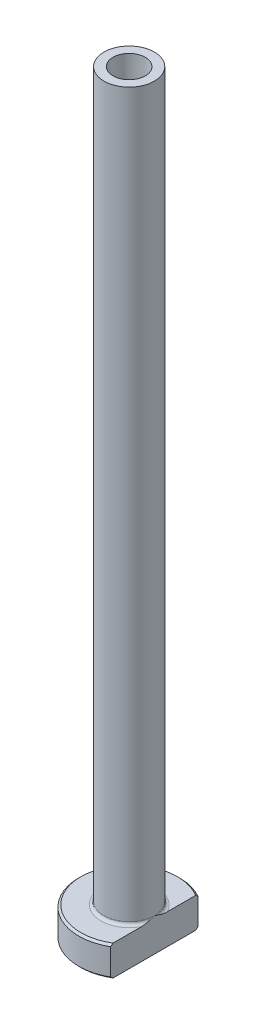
ISO-10303-21;
HEADER;
FILE_DESCRIPTION(('STEP AP214'),'2;1');
FILE_NAME('part.step','',(''),(''),'','','');
FILE_SCHEMA(('AUTOMOTIVE_DESIGN { 1 0 10303 214 1 1 1 1 }'));
ENDSEC;
DATA;
#1=APPLICATION_CONTEXT('core data for automotive mechanical design processes');
#2=APPLICATION_PROTOCOL_DEFINITION('international standard','automotive_design',2000,#1);
#3=PRODUCT_CONTEXT('',#1,'mechanical');
#4=PRODUCT('Part','Part','',(#3));
#5=PRODUCT_RELATED_PRODUCT_CATEGORY('part','',(#4));
#6=PRODUCT_DEFINITION_FORMATION('','',#4);
#7=PRODUCT_DEFINITION_CONTEXT('part definition',#1,'design');
#8=PRODUCT_DEFINITION('design','',#6,#7);
#9=PRODUCT_DEFINITION_SHAPE('','',#8);
#10=(LENGTH_UNIT() NAMED_UNIT(*) SI_UNIT(.MILLI.,.METRE.));
#11=(NAMED_UNIT(*) PLANE_ANGLE_UNIT() SI_UNIT($,.RADIAN.));
#12=(NAMED_UNIT(*) SI_UNIT($,.STERADIAN.) SOLID_ANGLE_UNIT());
#13=UNCERTAINTY_MEASURE_WITH_UNIT(LENGTH_MEASURE(1.E-05),#10,'distance_accuracy_value','');
#14=(GEOMETRIC_REPRESENTATION_CONTEXT(3) GLOBAL_UNCERTAINTY_ASSIGNED_CONTEXT((#13)) GLOBAL_UNIT_ASSIGNED_CONTEXT((#10,
#11,#12)) REPRESENTATION_CONTEXT('',''));
#15=CARTESIAN_POINT('',(0.,0.,0.));
#16=DIRECTION('',(0.,0.,1.));
#17=DIRECTION('',(1.,0.,0.));
#18=AXIS2_PLACEMENT_3D('',#15,#16,#17);
#19=CARTESIAN_POINT('',(0.,92.1876809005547,0.));
#20=DIRECTION('',(0.,1.,0.));
#21=DIRECTION('',(0.,0.,1.));
#22=AXIS2_PLACEMENT_3D('',#19,#20,#21);
#23=CYLINDRICAL_SURFACE('',#22,1.60000000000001);
#24=CARTESIAN_POINT('',(0.,75.,0.));
#25=DIRECTION('',(0.,1.,0.));
#26=DIRECTION('',(0.,0.,1.));
#27=AXIS2_PLACEMENT_3D('',#24,#25,#26);
#28=CIRCLE('',#27,1.60000000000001);
#29=CARTESIAN_POINT('',(0.,75.,1.60000000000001));
#30=VERTEX_POINT('',#29);
#31=EDGE_CURVE('E167',#30,#30,#28,.T.);
#32=ORIENTED_EDGE('',*,*,#31,.T.);
#33=EDGE_LOOP('',(#32));
#34=FACE_BOUND('',#33,.T.);
#35=CARTESIAN_POINT('',(0.,30.,0.));
#36=DIRECTION('',(0.,1.,0.));
#37=DIRECTION('',(0.,0.,1.));
#38=AXIS2_PLACEMENT_3D('',#35,#36,#37);
#39=CIRCLE('',#38,1.60000000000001);
#40=CARTESIAN_POINT('',(0.,30.,1.60000000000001));
#41=VERTEX_POINT('',#40);
#42=EDGE_CURVE('E170',#41,#41,#39,.T.);
#43=ORIENTED_EDGE('',*,*,#42,.F.);
#44=EDGE_LOOP('',(#43));
#45=FACE_BOUND('',#44,.T.);
#46=ADVANCED_FACE('F32',(#34,#45),#23,.F.);
#47=CARTESIAN_POINT('',(-1.60000000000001,75.,0.));
#48=DIRECTION('',(0.,1.,0.));
#49=DIRECTION('',(0.,0.,1.));
#50=AXIS2_PLACEMENT_3D('',#47,#48,#49);
#51=PLANE('',#50);
#52=CARTESIAN_POINT('',(0.,75.,0.));
#53=DIRECTION('',(0.,1.,0.));
#54=DIRECTION('',(0.,0.,1.));
#55=AXIS2_PLACEMENT_3D('',#52,#53,#54);
#56=CIRCLE('',#55,2.5);
#57=CARTESIAN_POINT('',(0.,75.,2.5));
#58=VERTEX_POINT('',#57);
#59=EDGE_CURVE('E174',#58,#58,#56,.T.);
#60=ORIENTED_EDGE('',*,*,#59,.T.);
#61=EDGE_LOOP('',(#60));
#62=FACE_BOUND('',#61,.T.);
#63=ORIENTED_EDGE('',*,*,#31,.F.);
#64=EDGE_LOOP('',(#63));
#65=FACE_BOUND('',#64,.T.);
#66=ADVANCED_FACE('F157',(#62,#65),#51,.T.);
#67=CARTESIAN_POINT('',(0.,92.1876809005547,0.));
#68=DIRECTION('',(0.,1.,0.));
#69=DIRECTION('',(0.,0.,1.));
#70=AXIS2_PLACEMENT_3D('',#67,#68,#69);
#71=CYLINDRICAL_SURFACE('',#70,2.49999999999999);
#72=CARTESIAN_POINT('',(0.,3.3,0.));
#73=DIRECTION('',(0.,1.,0.));
#74=DIRECTION('',(0.,0.,1.));
#75=AXIS2_PLACEMENT_3D('',#72,#73,#74);
#76=CIRCLE('',#75,2.49999999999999);
#77=CARTESIAN_POINT('',(2.49999999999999,3.3,0.));
#78=VERTEX_POINT('',#77);
#79=EDGE_CURVE('E180',#78,#78,#76,.T.);
#80=ORIENTED_EDGE('',*,*,#79,.T.);
#81=EDGE_LOOP('',(#80));
#82=FACE_BOUND('',#81,.T.);
#83=ORIENTED_EDGE('',*,*,#59,.F.);
#84=EDGE_LOOP('',(#83));
#85=FACE_BOUND('',#84,.T.);
#86=ADVANCED_FACE('F162',(#82,#85),#71,.T.);
#87=CARTESIAN_POINT('',(-2.49999999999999,3.,0.));
#88=DIRECTION('',(0.,1.,0.));
#89=DIRECTION('',(0.,0.,1.));
#90=AXIS2_PLACEMENT_3D('',#87,#88,#89);
#91=PLANE('',#90);
#92=DIRECTION('',(0.,0.,1.));
#93=VECTOR('',#92,1.);
#94=CARTESIAN_POINT('',(2.49999999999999,3.,0.));
#95=LINE('',#94,#93);
#96=CARTESIAN_POINT('',(2.49999999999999,3.,-4.09756024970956));
#97=VERTEX_POINT('',#96);
#98=CARTESIAN_POINT('',(2.49999999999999,3.,-1.26095202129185));
#99=VERTEX_POINT('',#98);
#100=EDGE_CURVE('E54',#97,#99,#95,.T.);
#101=ORIENTED_EDGE('',*,*,#100,.F.);
#102=CARTESIAN_POINT('',(0.,3.,0.));
#103=DIRECTION('',(0.,1.,0.));
#104=DIRECTION('',(0.,0.,1.));
#105=AXIS2_PLACEMENT_3D('',#102,#103,#104);
#106=CIRCLE('',#105,4.79999999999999);
#107=CARTESIAN_POINT('',(2.49999999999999,3.,4.09756024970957));
#108=VERTEX_POINT('',#107);
#109=EDGE_CURVE('E186',#97,#108,#106,.T.);
#110=ORIENTED_EDGE('',*,*,#109,.T.);
#111=CARTESIAN_POINT('',(2.49999999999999,3.,1.26095202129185));
#112=VERTEX_POINT('',#111);
#113=EDGE_CURVE('E134',#112,#108,#95,.T.);
#114=ORIENTED_EDGE('',*,*,#113,.F.);
#115=CARTESIAN_POINT('',(0.,3.,0.));
#116=DIRECTION('',(0.,1.,0.));
#117=DIRECTION('',(0.,0.,1.));
#118=AXIS2_PLACEMENT_3D('',#115,#116,#117);
#119=CIRCLE('',#118,2.79999999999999);
#120=EDGE_CURVE('E183',#112,#99,#119,.F.);
#121=ORIENTED_EDGE('',*,*,#120,.T.);
#122=EDGE_LOOP('',(#101,#110,#114,#121));
#123=FACE_BOUND('',#122,.T.);
#124=ADVANCED_FACE('F197',(#123),#91,.T.);
#125=CARTESIAN_POINT('',(0.,92.1876809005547,0.));
#126=DIRECTION('',(0.,1.,0.));
#127=DIRECTION('',(0.,0.,1.));
#128=AXIS2_PLACEMENT_3D('',#125,#126,#127);
#129=CYLINDRICAL_SURFACE('',#128,4.99999999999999);
#130=DIRECTION('',(0.,-1.,0.));
#131=VECTOR('',#130,1.);
#132=CARTESIAN_POINT('',(2.49999999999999,75.,4.33012701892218));
#133=LINE('',#132,#131);
#134=CARTESIAN_POINT('',(2.49999999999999,2.8,4.33012701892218));
#135=VERTEX_POINT('',#134);
#136=CARTESIAN_POINT('',(2.49999999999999,0.199999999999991,4.33012701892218));
#137=VERTEX_POINT('',#136);
#138=EDGE_CURVE('E82',#135,#137,#133,.T.);
#139=ORIENTED_EDGE('',*,*,#138,.F.);
#140=CARTESIAN_POINT('',(0.,2.8,0.));
#141=DIRECTION('',(0.,1.,0.));
#142=DIRECTION('',(0.,0.,1.));
#143=AXIS2_PLACEMENT_3D('',#140,#141,#142);
#144=CIRCLE('',#143,4.99999999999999);
#145=CARTESIAN_POINT('',(2.49999999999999,2.8,-4.33012701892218));
#146=VERTEX_POINT('',#145);
#147=EDGE_CURVE('E95',#135,#146,#144,.F.);
#148=ORIENTED_EDGE('',*,*,#147,.T.);
#149=DIRECTION('',(0.,-1.,0.));
#150=VECTOR('',#149,1.);
#151=CARTESIAN_POINT('',(2.49999999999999,75.,-4.33012701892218));
#152=LINE('',#151,#150);
#153=CARTESIAN_POINT('',(2.49999999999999,0.199999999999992,-4.33012701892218));
#154=VERTEX_POINT('',#153);
#155=EDGE_CURVE('E192',#146,#154,#152,.T.);
#156=ORIENTED_EDGE('',*,*,#155,.T.);
#157=CARTESIAN_POINT('',(0.,0.199999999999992,0.));
#158=DIRECTION('',(0.,-1.,0.));
#159=DIRECTION('',(0.,0.,-1.));
#160=AXIS2_PLACEMENT_3D('',#157,#158,#159);
#161=CIRCLE('',#160,4.99999999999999);
#162=EDGE_CURVE('E98',#154,#137,#161,.F.);
#163=ORIENTED_EDGE('',*,*,#162,.T.);
#164=EDGE_LOOP('',(#139,#148,#156,#163));
#165=FACE_BOUND('',#164,.T.);
#166=ADVANCED_FACE('F190',(#165),#129,.T.);
#167=CARTESIAN_POINT('',(-4.99999999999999,0.,0.));
#168=DIRECTION('',(0.,-1.,0.));
#169=DIRECTION('',(0.,0.,-1.));
#170=AXIS2_PLACEMENT_3D('',#167,#168,#169);
#171=PLANE('',#170);
#172=CARTESIAN_POINT('',(0.,0.,0.));
#173=DIRECTION('',(0.,-1.,0.));
#174=DIRECTION('',(0.,0.,-1.));
#175=AXIS2_PLACEMENT_3D('',#172,#173,#174);
#176=CIRCLE('',#175,2.34999999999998);
#177=CARTESIAN_POINT('',(0.,0.,-2.34999999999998));
#178=VERTEX_POINT('',#177);
#179=EDGE_CURVE('E40',#178,#178,#176,.F.);
#180=ORIENTED_EDGE('',*,*,#179,.T.);
#181=EDGE_LOOP('',(#180));
#182=FACE_BOUND('',#181,.T.);
#183=DIRECTION('',(0.,0.,-1.));
#184=VECTOR('',#183,1.);
#185=CARTESIAN_POINT('',(2.49999999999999,0.,4.33012701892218));
#186=LINE('',#185,#184);
#187=CARTESIAN_POINT('',(2.49999999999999,0.,4.09756024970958));
#188=VERTEX_POINT('',#187);
#189=CARTESIAN_POINT('',(2.49999999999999,0.,-4.09756024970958));
#190=VERTEX_POINT('',#189);
#191=EDGE_CURVE('E47',#188,#190,#186,.T.);
#192=ORIENTED_EDGE('',*,*,#191,.F.);
#193=CARTESIAN_POINT('',(0.,0.,0.));
#194=DIRECTION('',(0.,-1.,0.));
#195=DIRECTION('',(0.,0.,-1.));
#196=AXIS2_PLACEMENT_3D('',#193,#194,#195);
#197=CIRCLE('',#196,4.8);
#198=EDGE_CURVE('E92',#188,#190,#197,.T.);
#199=ORIENTED_EDGE('',*,*,#198,.T.);
#200=EDGE_LOOP('',(#192,#199));
#201=FACE_BOUND('',#200,.T.);
#202=ADVANCED_FACE('F91',(#182,#201),#171,.T.);
#203=CARTESIAN_POINT('',(0.,92.1876809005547,0.));
#204=DIRECTION('',(0.,1.,0.));
#205=DIRECTION('',(0.,0.,1.));
#206=AXIS2_PLACEMENT_3D('',#203,#204,#205);
#207=CYLINDRICAL_SURFACE('',#206,1.84999999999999);
#208=CARTESIAN_POINT('',(0.,0.5,0.));
#209=DIRECTION('',(0.,-1.,0.));
#210=DIRECTION('',(0.,0.,-1.));
#211=AXIS2_PLACEMENT_3D('',#208,#209,#210);
#212=CIRCLE('',#211,1.84999999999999);
#213=CARTESIAN_POINT('',(0.,0.5,-1.84999999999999));
#214=VERTEX_POINT('',#213);
#215=EDGE_CURVE('E11',#214,#214,#212,.T.);
#216=ORIENTED_EDGE('',*,*,#215,.T.);
#217=EDGE_LOOP('',(#216));
#218=FACE_BOUND('',#217,.T.);
#219=CARTESIAN_POINT('',(0.,18.,0.));
#220=DIRECTION('',(0.,1.,0.));
#221=DIRECTION('',(0.,0.,1.));
#222=AXIS2_PLACEMENT_3D('',#219,#220,#221);
#223=CIRCLE('',#222,1.84999999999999);
#224=CARTESIAN_POINT('',(0.,18.,1.84999999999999));
#225=VERTEX_POINT('',#224);
#226=EDGE_CURVE('E172',#225,#225,#223,.T.);
#227=ORIENTED_EDGE('',*,*,#226,.T.);
#228=EDGE_LOOP('',(#227));
#229=FACE_BOUND('',#228,.T.);
#230=ADVANCED_FACE('F215',(#218,#229),#207,.F.);
#231=CARTESIAN_POINT('',(0.,18.,0.));
#232=DIRECTION('',(0.,-1.,0.));
#233=DIRECTION('',(0.,0.,-1.));
#234=AXIS2_PLACEMENT_3D('',#231,#232,#233);
#235=CONICAL_SURFACE('',#234,1.84999999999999,0.0208303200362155);
#236=ORIENTED_EDGE('',*,*,#42,.T.);
#237=EDGE_LOOP('',(#236));
#238=FACE_BOUND('',#237,.T.);
#239=ORIENTED_EDGE('',*,*,#226,.F.);
#240=EDGE_LOOP('',(#239));
#241=FACE_BOUND('',#240,.T.);
#242=ADVANCED_FACE('F111',(#238,#241),#235,.F.);
#243=CARTESIAN_POINT('',(0.,3.3,0.));
#244=DIRECTION('',(0.,1.,0.));
#245=DIRECTION('',(0.,0.,1.));
#246=AXIS2_PLACEMENT_3D('',#243,#244,#245);
#247=TOROIDAL_SURFACE('',#246,2.79999999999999,0.3);
#248=ORIENTED_EDGE('',*,*,#120,.F.);
#249=CARTESIAN_POINT('',(2.49999999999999,3.3,0.));
#250=CARTESIAN_POINT('',(2.49999999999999,3.30000062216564,-4.84268097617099E-11));
#251=CARTESIAN_POINT('',(2.49999999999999,3.30000124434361,1.59620957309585E-07));
#252=CARTESIAN_POINT('',(2.49999999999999,3.30000243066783,6.45477727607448E-07));
#253=CARTESIAN_POINT('',(2.49999999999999,3.30000299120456,9.784804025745E-07));
#254=CARTESIAN_POINT('',(2.49999999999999,3.30000411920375,1.77471937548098E-06));
#255=CARTESIAN_POINT('',(2.49999999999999,3.30000467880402,2.24902093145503E-06));
#256=CARTESIAN_POINT('',(2.49999999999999,3.30000572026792,3.25953621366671E-06));
#257=CARTESIAN_POINT('',(2.49999999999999,3.3000062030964,3.79480683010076E-06));
#258=CARTESIAN_POINT('',(2.49999999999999,3.30000787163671,5.75794545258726E-06));
#259=CARTESIAN_POINT('',(2.49999999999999,3.30000896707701,7.26424016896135E-06));
#260=CARTESIAN_POINT('',(2.49999999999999,3.30001087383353,1.0336111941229E-05));
#261=CARTESIAN_POINT('',(2.49999999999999,3.3000116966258,1.18949489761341E-05));
#262=CARTESIAN_POINT('',(2.49999999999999,3.30001489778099,1.81400836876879E-05));
#263=CARTESIAN_POINT('',(2.49999999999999,3.30001712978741,2.29062159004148E-05));
#264=CARTESIAN_POINT('',(2.49999999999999,3.30002067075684,3.21793844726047E-05));
#265=CARTESIAN_POINT('',(2.49999999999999,3.30002205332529,3.66588967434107E-05));
#266=CARTESIAN_POINT('',(2.49999999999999,3.30002810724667,5.61718370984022E-05));
#267=CARTESIAN_POINT('',(2.49999999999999,3.30003284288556,7.11735820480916E-05));
#268=CARTESIAN_POINT('',(2.49999999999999,3.30004025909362,9.89920273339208E-05));
#269=CARTESIAN_POINT('',(2.49999999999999,3.30004315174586,0.000111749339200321));
#270=CARTESIAN_POINT('',(2.49999999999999,3.30006652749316,0.000206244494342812));
#271=CARTESIAN_POINT('',(2.49999999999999,3.30009698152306,0.000285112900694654));
#272=CARTESIAN_POINT('',(2.49999999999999,3.3002121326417,0.000594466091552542));
#273=CARTESIAN_POINT('',(2.49999999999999,3.30028938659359,0.000826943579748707));
#274=CARTESIAN_POINT('',(2.49999999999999,3.30059681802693,0.0017388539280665));
#275=CARTESIAN_POINT('',(2.49999999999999,3.30083479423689,0.00241625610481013));
#276=CARTESIAN_POINT('',(2.49999999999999,3.30181198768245,0.00521069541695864));
#277=CARTESIAN_POINT('',(2.49999999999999,3.30254240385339,0.00732996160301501));
#278=CARTESIAN_POINT('',(2.49999999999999,3.31226043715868,0.0355096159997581));
#279=CARTESIAN_POINT('',(2.49999999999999,3.32130808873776,0.0615551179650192));
#280=CARTESIAN_POINT('',(2.49999999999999,3.33896212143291,0.112677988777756));
#281=CARTESIAN_POINT('',(2.49999999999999,3.34757212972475,0.137754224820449));
#282=CARTESIAN_POINT('',(2.49999999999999,3.36573068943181,0.1909818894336));
#283=CARTESIAN_POINT('',(2.49999999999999,3.37526654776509,0.219137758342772));
#284=CARTESIAN_POINT('',(2.49999999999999,3.39422867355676,0.275816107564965));
#285=CARTESIAN_POINT('',(2.49999999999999,3.40365272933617,0.304339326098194));
#286=CARTESIAN_POINT('',(2.49999999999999,3.42641697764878,0.374416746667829));
#287=CARTESIAN_POINT('',(2.49999999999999,3.43959811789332,0.416023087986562));
#288=CARTESIAN_POINT('',(2.49999999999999,3.46479157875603,0.498481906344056));
#289=CARTESIAN_POINT('',(2.49999999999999,3.47682455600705,0.539328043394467));
#290=CARTESIAN_POINT('',(2.49999999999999,3.50224427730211,0.62998152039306));
#291=CARTESIAN_POINT('',(2.49999999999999,3.51538048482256,0.679860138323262));
#292=CARTESIAN_POINT('',(2.49999999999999,3.53964074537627,0.780511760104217));
#293=CARTESIAN_POINT('',(2.49999999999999,3.55074877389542,0.831288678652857));
#294=CARTESIAN_POINT('',(2.49999999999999,3.57087054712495,0.937063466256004));
#295=CARTESIAN_POINT('',(2.49999999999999,3.5796762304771,0.992102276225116));
#296=CARTESIAN_POINT('',(2.49999999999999,3.59301148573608,1.10256024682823));
#297=CARTESIAN_POINT('',(2.49999999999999,3.59755297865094,1.1579779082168));
#298=CARTESIAN_POINT('',(2.49999999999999,3.60093314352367,1.26786705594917));
#299=CARTESIAN_POINT('',(2.49999999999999,3.59989366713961,1.32233291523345));
#300=CARTESIAN_POINT('',(2.49999999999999,3.59277279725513,1.40310062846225));
#301=CARTESIAN_POINT('',(2.49999999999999,3.58952137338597,1.42965222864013));
#302=CARTESIAN_POINT('',(2.49999999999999,3.58085857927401,1.48239078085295));
#303=CARTESIAN_POINT('',(2.49999999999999,3.57544928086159,1.50857805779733));
#304=CARTESIAN_POINT('',(2.49999999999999,3.56298810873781,1.55658799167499));
#305=CARTESIAN_POINT('',(2.49999999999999,3.55628200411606,1.57849902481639));
#306=CARTESIAN_POINT('',(2.49999999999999,3.54055393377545,1.62160292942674));
#307=CARTESIAN_POINT('',(2.49999999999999,3.53152220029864,1.64279233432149));
#308=CARTESIAN_POINT('',(2.49999999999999,3.51057199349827,1.68404469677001));
#309=CARTESIAN_POINT('',(2.49999999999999,3.49862012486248,1.70409105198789));
#310=CARTESIAN_POINT('',(2.49999999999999,3.47134074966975,1.74172093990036));
#311=CARTESIAN_POINT('',(2.49999999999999,3.45603127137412,1.75931683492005));
#312=CARTESIAN_POINT('',(2.49999999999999,3.42979930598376,1.78297070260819));
#313=CARTESIAN_POINT('',(2.49999999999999,3.42024268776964,1.79054141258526));
#314=CARTESIAN_POINT('',(2.49999999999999,3.40009035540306,1.80416997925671));
#315=CARTESIAN_POINT('',(2.49999999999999,3.38949499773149,1.81022835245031));
#316=CARTESIAN_POINT('',(2.49999999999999,3.36727740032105,1.82047087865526));
#317=CARTESIAN_POINT('',(2.49999999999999,3.35564531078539,1.82463409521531));
#318=CARTESIAN_POINT('',(2.49999999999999,3.33178837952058,1.83058442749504));
#319=CARTESIAN_POINT('',(2.49999999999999,3.31956435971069,1.83237474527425));
#320=CARTESIAN_POINT('',(2.49999999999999,3.29665736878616,1.83331852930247));
#321=CARTESIAN_POINT('',(2.49999999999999,3.28598670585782,1.83279233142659));
#322=CARTESIAN_POINT('',(2.49999999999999,3.26490749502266,1.82986307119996));
#323=CARTESIAN_POINT('',(2.49999999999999,3.25449899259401,1.82745968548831));
#324=CARTESIAN_POINT('',(2.49999999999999,3.2346709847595,1.8211125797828));
#325=CARTESIAN_POINT('',(2.49999999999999,3.22522816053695,1.81724026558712));
#326=CARTESIAN_POINT('',(2.49999999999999,3.20699535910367,1.80819497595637));
#327=CARTESIAN_POINT('',(2.49999999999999,3.19820556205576,1.80302164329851));
#328=CARTESIAN_POINT('',(2.49999999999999,3.17663162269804,1.7884211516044));
#329=CARTESIAN_POINT('',(2.49999999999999,3.16436228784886,1.77823293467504));
#330=CARTESIAN_POINT('',(2.49999999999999,3.14157828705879,1.75604629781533));
#331=CARTESIAN_POINT('',(2.49999999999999,3.13106906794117,1.74404246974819));
#332=CARTESIAN_POINT('',(2.49999999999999,3.10600520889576,1.71142114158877));
#333=CARTESIAN_POINT('',(2.49999999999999,3.09267476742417,1.68986887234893));
#334=CARTESIAN_POINT('',(2.49999999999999,3.06940323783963,1.64508572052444));
#335=CARTESIAN_POINT('',(2.49999999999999,3.05946314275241,1.62185434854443));
#336=CARTESIAN_POINT('',(2.49999999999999,3.03545750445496,1.55546754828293));
#337=CARTESIAN_POINT('',(2.49999999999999,3.02444022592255,1.5112218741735));
#338=CARTESIAN_POINT('',(2.49999999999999,3.00863926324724,1.42119777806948));
#339=CARTESIAN_POINT('',(2.49999999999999,3.00393876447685,1.37540689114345));
#340=CARTESIAN_POINT('',(2.49999999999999,2.99924212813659,1.280721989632));
#341=CARTESIAN_POINT('',(2.49999999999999,2.99956098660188,1.23181420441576));
#342=CARTESIAN_POINT('',(2.49999999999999,3.00436098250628,1.13410944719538));
#343=CARTESIAN_POINT('',(2.49999999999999,3.00885327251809,1.08531312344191));
#344=CARTESIAN_POINT('',(2.49999999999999,3.02074191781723,0.99077345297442));
#345=CARTESIAN_POINT('',(2.49999999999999,3.02796792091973,0.945007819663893));
#346=CARTESIAN_POINT('',(2.49999999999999,3.04465555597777,0.85419946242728));
#347=CARTESIAN_POINT('',(2.49999999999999,3.05410250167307,0.809153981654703));
#348=CARTESIAN_POINT('',(2.49999999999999,3.07710029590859,0.709411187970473));
#349=CARTESIAN_POINT('',(2.49999999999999,3.09109633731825,0.654817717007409));
#350=CARTESIAN_POINT('',(2.49999999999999,3.12140740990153,0.544863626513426));
#351=CARTESIAN_POINT('',(2.49999999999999,3.13777040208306,0.489516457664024));
#352=CARTESIAN_POINT('',(2.49999999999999,3.16649540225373,0.396740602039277));
#353=CARTESIAN_POINT('',(2.5,3.17848130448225,0.35919385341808));
#354=CARTESIAN_POINT('',(2.49999999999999,3.20280507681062,0.28465180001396));
#355=CARTESIAN_POINT('',(2.49999999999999,3.21513791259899,0.247654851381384));
#356=CARTESIAN_POINT('',(2.5,3.23873713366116,0.177767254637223));
#357=CARTESIAN_POINT('',(2.5,3.24997409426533,0.144866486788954));
#358=CARTESIAN_POINT('',(2.49999999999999,3.27307149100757,0.0777985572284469));
#359=CARTESIAN_POINT('',(2.49999999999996,3.28493883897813,0.0436336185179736));
#360=CARTESIAN_POINT('',(2.5,3.29745794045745,0.00732879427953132));
#361=CARTESIAN_POINT('',(2.5,3.29818879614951,0.00520838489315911));
#362=CARTESIAN_POINT('',(2.49999999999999,3.29916610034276,0.00241367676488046));
#363=CARTESIAN_POINT('',(2.49999999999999,3.29940376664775,0.00173715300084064));
#364=CARTESIAN_POINT('',(2.5,3.29971082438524,0.000826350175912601));
#365=CARTESIAN_POINT('',(2.5,3.29978800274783,0.000594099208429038));
#366=CARTESIAN_POINT('',(2.49999999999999,3.29990305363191,0.000285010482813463));
#367=CARTESIAN_POINT('',(2.49999999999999,3.29993349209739,0.00020618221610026));
#368=CARTESIAN_POINT('',(2.49999999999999,3.299956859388,0.000111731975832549));
#369=CARTESIAN_POINT('',(2.5,3.29995975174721,9.89774262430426E-05));
#370=CARTESIAN_POINT('',(2.5,3.29996716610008,7.11651832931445E-05));
#371=CARTESIAN_POINT('',(2.49999999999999,3.29997189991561,5.61668057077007E-05));
#372=CARTESIAN_POINT('',(2.49999999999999,3.2999779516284,3.6657630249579E-05));
#373=CARTESIAN_POINT('',(2.49999999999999,3.29997933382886,3.21785218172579E-05));
#374=CARTESIAN_POINT('',(2.49999999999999,3.29998287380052,2.29061351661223E-05));
#375=CARTESIAN_POINT('',(2.49999999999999,3.29998510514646,1.81403642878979E-05));
#376=CARTESIAN_POINT('',(2.49999999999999,3.29998830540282,1.18955810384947E-05));
#377=CARTESIAN_POINT('',(2.49999999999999,3.29998912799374,1.03367749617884E-05));
#378=CARTESIAN_POINT('',(2.49999999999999,3.29999103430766,7.26492671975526E-06));
#379=CARTESIAN_POINT('',(2.49999999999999,3.29999212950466,5.75862185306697E-06));
#380=CARTESIAN_POINT('',(2.49999999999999,3.29999379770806,3.79542398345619E-06));
#381=CARTESIAN_POINT('',(2.49999999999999,3.2999942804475,3.26012692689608E-06));
#382=CARTESIAN_POINT('',(2.49999999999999,3.29999532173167,2.24954273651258E-06));
#383=CARTESIAN_POINT('',(2.49999999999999,3.29999588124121,1.77519843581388E-06));
#384=CARTESIAN_POINT('',(2.49999999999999,3.29999700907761,9.78856738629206E-07));
#385=CARTESIAN_POINT('',(2.49999999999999,3.29999756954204,6.45796776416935E-07));
#386=CARTESIAN_POINT('',(2.49999999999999,3.29999875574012,1.59799494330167E-07));
#387=CARTESIAN_POINT('',(2.49999999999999,3.2999993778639,4.84250111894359E-11));
#388=CARTESIAN_POINT('',(2.49999999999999,3.3,0.));
#389=B_SPLINE_CURVE_WITH_KNOTS('',3,(#249,#250,#251,#252,#253,#254,#255,#256,#257,#258,#259,
#260,#261,#262,#263,#264,#265,#266,#267,#268,#269,#270,#271,#272,#273,#274,#275,#276,#277,#278,
#279,#280,#281,#282,#283,#284,#285,#286,#287,#288,#289,#290,#291,#292,#293,#294,#295,#296,#297,
#298,#299,#300,#301,#302,#303,#304,#305,#306,#307,#308,#309,#310,#311,#312,#313,#314,#315,#316,
#317,#318,#319,#320,#321,#322,#323,#324,#325,#326,#327,#328,#329,#330,#331,#332,#333,#334,#335,
#336,#337,#338,#339,#340,#341,#342,#343,#344,#345,#346,#347,#348,#349,#350,#351,#352,#353,#354,
#355,#356,#357,#358,#359,#360,#361,#362,#363,#364,#365,#366,#367,#368,#369,#370,#371,#372,#373,
#374,#375,#376,#377,#378,#379,#380,#381,#382,#383,#384,#385,#386,#387,#388),.UNSPECIFIED.,.T.,
.F.,(4,2,2,2,2,2,2,2,2,2,2,2,2,2,2,2,2,2,2,2,2,2,2,2,2,2,2,2,2,2,2,2,2,2,2,2,2,2,2,2,2,2,2,2,2,
2,2,2,2,2,2,2,2,2,2,2,2,2,2,2,2,2,2,2,2,2,2,2,2,4),(0.,1.86789340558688E-06,
3.81549813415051E-06,6.00610739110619E-06,8.16653309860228E-06,1.37285630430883E-05,
1.9012222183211E-05,3.47597341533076E-05,4.88082683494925E-05,9.59978494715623E-05,
0.000135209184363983,0.000388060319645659,0.00112364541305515,0.00327678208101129,
0.010002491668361,0.0927120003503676,0.172253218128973,0.261432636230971,0.351551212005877,
0.482477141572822,0.610212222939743,0.76491521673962,0.920792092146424,1.0878789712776,
1.2544973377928,1.41749285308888,1.49767530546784,1.57778095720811,1.64642481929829,
1.71536183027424,1.78512750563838,1.85452737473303,1.89099315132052,1.92744645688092,
1.96429324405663,2.00109025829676,2.03297105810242,2.06485735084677,2.09535926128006,
2.1258695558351,2.17344034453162,2.22115572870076,2.2967513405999,2.37236907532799,
2.50839721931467,2.64619971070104,2.79268284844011,2.93955855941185,3.07848421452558,
3.21651583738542,3.38554045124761,3.55865938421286,3.67689643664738,3.79388863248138,
3.89819085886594,4.00668323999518,4.01341261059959,4.0155629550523,4.01629782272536,
4.01655054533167,4.0165897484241,4.01663692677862,4.01665097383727,4.01666671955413,
4.01667200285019,4.01667756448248,4.01667972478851,4.01668191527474,4.01668386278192,
4.01668573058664),.UNSPECIFIED.);
#390=EDGE_CURVE('E126',#112,#78,#389,.T.);
#391=ORIENTED_EDGE('',*,*,#390,.T.);
#392=ORIENTED_EDGE('',*,*,#79,.F.);
#393=CARTESIAN_POINT('',(2.49999999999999,3.3,0.));
#394=CARTESIAN_POINT('',(2.49999999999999,3.29999937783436,4.84272220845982E-11));
#395=CARTESIAN_POINT('',(2.49999999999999,3.29999875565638,-1.59620956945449E-07));
#396=CARTESIAN_POINT('',(2.49999999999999,3.29999756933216,-6.45477727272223E-07));
#397=CARTESIAN_POINT('',(2.49999999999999,3.29999700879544,-9.78480402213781E-07));
#398=CARTESIAN_POINT('',(2.49999999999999,3.29999588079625,-1.77471937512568E-06));
#399=CARTESIAN_POINT('',(2.49999999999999,3.29999532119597,-2.24902093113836E-06));
#400=CARTESIAN_POINT('',(2.49999999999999,3.29999427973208,-3.25953621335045E-06));
#401=CARTESIAN_POINT('',(2.49999999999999,3.2999937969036,-3.79480682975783E-06));
#402=CARTESIAN_POINT('',(2.49999999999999,3.29999212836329,-5.7579454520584E-06));
#403=CARTESIAN_POINT('',(2.49999999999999,3.29999103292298,-7.2642401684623E-06));
#404=CARTESIAN_POINT('',(2.49999999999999,3.29998912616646,-1.03361119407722E-05));
#405=CARTESIAN_POINT('',(2.49999999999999,3.2999883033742,-1.18949489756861E-05));
#406=CARTESIAN_POINT('',(2.49999999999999,3.299985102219,-1.81400836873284E-05));
#407=CARTESIAN_POINT('',(2.49999999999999,3.29998287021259,-2.29062158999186E-05));
#408=CARTESIAN_POINT('',(2.49999999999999,3.29997932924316,-3.21793844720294E-05));
#409=CARTESIAN_POINT('',(2.49999999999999,3.29997794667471,-3.66588967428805E-05));
#410=CARTESIAN_POINT('',(2.49999999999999,3.29997189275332,-5.61718370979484E-05));
#411=CARTESIAN_POINT('',(2.49999999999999,3.29996715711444,-7.11735820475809E-05));
#412=CARTESIAN_POINT('',(2.49999999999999,3.29995974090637,-9.89920273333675E-05));
#413=CARTESIAN_POINT('',(2.49999999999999,3.29995684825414,-0.000111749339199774));
#414=CARTESIAN_POINT('',(2.49999999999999,3.29993347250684,-0.000206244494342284));
#415=CARTESIAN_POINT('',(2.49999999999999,3.29990301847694,-0.000285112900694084));
#416=CARTESIAN_POINT('',(2.49999999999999,3.2997878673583,-0.000594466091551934));
#417=CARTESIAN_POINT('',(2.49999999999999,3.29971061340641,-0.000826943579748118));
#418=CARTESIAN_POINT('',(2.49999999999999,3.29940318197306,-0.00173885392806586));
#419=CARTESIAN_POINT('',(2.49999999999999,3.29916520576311,-0.00241625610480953));
#420=CARTESIAN_POINT('',(2.49999999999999,3.29818801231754,-0.00521069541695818));
#421=CARTESIAN_POINT('',(2.49999999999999,3.2974575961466,-0.0073299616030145));
#422=CARTESIAN_POINT('',(2.49999999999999,3.28773956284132,-0.0355096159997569));
#423=CARTESIAN_POINT('',(2.49999999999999,3.27869191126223,-0.0615551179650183));
#424=CARTESIAN_POINT('',(2.49999999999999,3.26103787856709,-0.112677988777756));
#425=CARTESIAN_POINT('',(2.49999999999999,3.25242787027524,-0.137754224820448));
#426=CARTESIAN_POINT('',(2.49999999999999,3.23426931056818,-0.190981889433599));
#427=CARTESIAN_POINT('',(2.49999999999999,3.2247334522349,-0.21913775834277));
#428=CARTESIAN_POINT('',(2.49999999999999,3.20577132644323,-0.275816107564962));
#429=CARTESIAN_POINT('',(2.49999999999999,3.19634727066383,-0.304339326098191));
#430=CARTESIAN_POINT('',(2.49999999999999,3.17358302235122,-0.374416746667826));
#431=CARTESIAN_POINT('',(2.49999999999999,3.16040188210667,-0.416023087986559));
#432=CARTESIAN_POINT('',(2.49999999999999,3.13520842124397,-0.498481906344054));
#433=CARTESIAN_POINT('',(2.49999999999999,3.12317544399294,-0.539328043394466));
#434=CARTESIAN_POINT('',(2.49999999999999,3.09775572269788,-0.629981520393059));
#435=CARTESIAN_POINT('',(2.49999999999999,3.08461951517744,-0.679860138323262));
#436=CARTESIAN_POINT('',(2.49999999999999,3.06035925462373,-0.780511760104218));
#437=CARTESIAN_POINT('',(2.49999999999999,3.04925122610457,-0.831288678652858));
#438=CARTESIAN_POINT('',(2.49999999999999,3.02912945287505,-0.937063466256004));
#439=CARTESIAN_POINT('',(2.49999999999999,3.0203237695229,-0.992102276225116));
#440=CARTESIAN_POINT('',(2.49999999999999,3.00698851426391,-1.10256024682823));
#441=CARTESIAN_POINT('',(2.49999999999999,3.00244702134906,-1.1579779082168));
#442=CARTESIAN_POINT('',(2.49999999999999,2.99906685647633,-1.26786705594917));
#443=CARTESIAN_POINT('',(2.49999999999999,3.00010633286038,-1.32233291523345));
#444=CARTESIAN_POINT('',(2.49999999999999,3.00722720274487,-1.40310062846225));
#445=CARTESIAN_POINT('',(2.49999999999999,3.01047862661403,-1.42965222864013));
#446=CARTESIAN_POINT('',(2.49999999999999,3.01914142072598,-1.48239078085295));
#447=CARTESIAN_POINT('',(2.49999999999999,3.0245507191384,-1.50857805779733));
#448=CARTESIAN_POINT('',(2.49999999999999,3.03701189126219,-1.55658799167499));
#449=CARTESIAN_POINT('',(2.49999999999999,3.04371799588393,-1.57849902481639));
#450=CARTESIAN_POINT('',(2.49999999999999,3.05944606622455,-1.62160292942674));
#451=CARTESIAN_POINT('',(2.49999999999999,3.06847779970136,-1.64279233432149));
#452=CARTESIAN_POINT('',(2.49999999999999,3.08942800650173,-1.68404469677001));
#453=CARTESIAN_POINT('',(2.49999999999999,3.10137987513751,-1.70409105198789));
#454=CARTESIAN_POINT('',(2.49999999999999,3.12865925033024,-1.74172093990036));
#455=CARTESIAN_POINT('',(2.49999999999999,3.14396872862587,-1.75931683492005));
#456=CARTESIAN_POINT('',(2.49999999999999,3.17020069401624,-1.78297070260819));
#457=CARTESIAN_POINT('',(2.49999999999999,3.17975731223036,-1.79054141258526));
#458=CARTESIAN_POINT('',(2.49999999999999,3.19990964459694,-1.80416997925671));
#459=CARTESIAN_POINT('',(2.49999999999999,3.21050500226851,-1.81022835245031));
#460=CARTESIAN_POINT('',(2.49999999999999,3.23272259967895,-1.82047087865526));
#461=CARTESIAN_POINT('',(2.49999999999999,3.2443546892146,-1.82463409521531));
#462=CARTESIAN_POINT('',(2.49999999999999,3.26821162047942,-1.83058442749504));
#463=CARTESIAN_POINT('',(2.49999999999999,3.2804356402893,-1.83237474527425));
#464=CARTESIAN_POINT('',(2.49999999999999,3.30334263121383,-1.83331852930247));
#465=CARTESIAN_POINT('',(2.49999999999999,3.31401329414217,-1.83279233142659));
#466=CARTESIAN_POINT('',(2.49999999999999,3.33509250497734,-1.82986307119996));
#467=CARTESIAN_POINT('',(2.49999999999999,3.34550100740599,-1.82745968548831));
#468=CARTESIAN_POINT('',(2.49999999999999,3.3653290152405,-1.8211125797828));
#469=CARTESIAN_POINT('',(2.49999999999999,3.37477183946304,-1.81724026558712));
#470=CARTESIAN_POINT('',(2.49999999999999,3.39300464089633,-1.80819497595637));
#471=CARTESIAN_POINT('',(2.49999999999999,3.40179443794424,-1.80302164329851));
#472=CARTESIAN_POINT('',(2.49999999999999,3.42336837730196,-1.7884211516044));
#473=CARTESIAN_POINT('',(2.49999999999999,3.43563771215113,-1.77823293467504));
#474=CARTESIAN_POINT('',(2.49999999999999,3.4584217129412,-1.75604629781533));
#475=CARTESIAN_POINT('',(2.49999999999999,3.46893093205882,-1.74404246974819));
#476=CARTESIAN_POINT('',(2.49999999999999,3.49399479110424,-1.71142114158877));
#477=CARTESIAN_POINT('',(2.49999999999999,3.50732523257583,-1.68986887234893));
#478=CARTESIAN_POINT('',(2.49999999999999,3.53059676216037,-1.64508572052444));
#479=CARTESIAN_POINT('',(2.49999999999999,3.54053685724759,-1.62185434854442));
#480=CARTESIAN_POINT('',(2.49999999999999,3.56454249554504,-1.55546754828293));
#481=CARTESIAN_POINT('',(2.49999999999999,3.57555977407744,-1.5112218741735));
#482=CARTESIAN_POINT('',(2.49999999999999,3.59136073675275,-1.42119777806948));
#483=CARTESIAN_POINT('',(2.49999999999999,3.59606123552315,-1.37540689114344));
#484=CARTESIAN_POINT('',(2.49999999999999,3.6007578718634,-1.280721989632));
#485=CARTESIAN_POINT('',(2.49999999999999,3.60043901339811,-1.23181420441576));
#486=CARTESIAN_POINT('',(2.49999999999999,3.59563901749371,-1.13410944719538));
#487=CARTESIAN_POINT('',(2.49999999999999,3.5911467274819,-1.08531312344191));
#488=CARTESIAN_POINT('',(2.49999999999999,3.57925808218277,-0.99077345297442));
#489=CARTESIAN_POINT('',(2.49999999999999,3.57203207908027,-0.945007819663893));
#490=CARTESIAN_POINT('',(2.49999999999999,3.55534444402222,-0.85419946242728));
#491=CARTESIAN_POINT('',(2.49999999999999,3.54589749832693,-0.809153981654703));
#492=CARTESIAN_POINT('',(2.49999999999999,3.52289970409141,-0.709411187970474));
#493=CARTESIAN_POINT('',(2.49999999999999,3.50890366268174,-0.65481771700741));
#494=CARTESIAN_POINT('',(2.49999999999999,3.47859259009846,-0.544863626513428));
#495=CARTESIAN_POINT('',(2.49999999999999,3.46222959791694,-0.489516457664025));
#496=CARTESIAN_POINT('',(2.49999999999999,3.43350459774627,-0.396740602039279));
#497=CARTESIAN_POINT('',(2.49999999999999,3.42151869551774,-0.359193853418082));
#498=CARTESIAN_POINT('',(2.49999999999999,3.39719492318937,-0.284651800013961));
#499=CARTESIAN_POINT('',(2.49999999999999,3.384862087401,-0.247654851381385));
#500=CARTESIAN_POINT('',(2.49999999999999,3.36126286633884,-0.177767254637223));
#501=CARTESIAN_POINT('',(2.49999999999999,3.35002590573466,-0.144866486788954));
#502=CARTESIAN_POINT('',(2.49999999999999,3.32692850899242,-0.0777985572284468));
#503=CARTESIAN_POINT('',(2.49999999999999,3.31506116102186,-0.0436336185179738));
#504=CARTESIAN_POINT('',(2.49999999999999,3.30254205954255,-0.00732879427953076));
#505=CARTESIAN_POINT('',(2.49999999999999,3.30181120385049,-0.00520838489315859));
#506=CARTESIAN_POINT('',(2.49999999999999,3.30083389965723,-0.00241367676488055));
#507=CARTESIAN_POINT('',(2.49999999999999,3.30059623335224,-0.00173715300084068));
#508=CARTESIAN_POINT('',(2.49999999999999,3.30028917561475,-0.000826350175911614));
#509=CARTESIAN_POINT('',(2.49999999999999,3.30021199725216,-0.000594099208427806));
#510=CARTESIAN_POINT('',(2.49999999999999,3.30009694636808,-0.000285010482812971));
#511=CARTESIAN_POINT('',(2.49999999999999,3.3000665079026,-0.000206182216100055));
#512=CARTESIAN_POINT('',(2.49999999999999,3.30004314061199,-0.000111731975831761));
#513=CARTESIAN_POINT('',(2.49999999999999,3.30004024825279,-9.89774262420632E-05));
#514=CARTESIAN_POINT('',(2.49999999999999,3.30003283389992,-7.11651832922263E-05));
#515=CARTESIAN_POINT('',(2.49999999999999,3.30002810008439,-5.61668057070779E-05));
#516=CARTESIAN_POINT('',(2.49999999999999,3.3000220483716,-3.6657630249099E-05));
#517=CARTESIAN_POINT('',(2.49999999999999,3.30002066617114,-3.21785218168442E-05));
#518=CARTESIAN_POINT('',(2.49999999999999,3.30001712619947,-2.29061351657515E-05));
#519=CARTESIAN_POINT('',(2.49999999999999,3.30001489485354,-1.81403642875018E-05));
#520=CARTESIAN_POINT('',(2.49999999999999,3.30001169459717,-1.18955810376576E-05));
#521=CARTESIAN_POINT('',(2.49999999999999,3.30001087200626,-1.03367749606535E-05));
#522=CARTESIAN_POINT('',(2.49999999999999,3.30000896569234,-7.26492671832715E-06));
#523=CARTESIAN_POINT('',(2.49999999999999,3.30000787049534,-5.75862185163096E-06));
#524=CARTESIAN_POINT('',(2.49999999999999,3.30000620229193,-3.7954239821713E-06));
#525=CARTESIAN_POINT('',(2.49999999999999,3.30000571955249,-3.26012692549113E-06));
#526=CARTESIAN_POINT('',(2.49999999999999,3.30000467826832,-2.24954273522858E-06));
#527=CARTESIAN_POINT('',(2.49999999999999,3.30000411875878,-1.7751984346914E-06));
#528=CARTESIAN_POINT('',(2.49999999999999,3.30000299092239,-9.78856737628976E-07));
#529=CARTESIAN_POINT('',(2.49999999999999,3.30000243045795,-6.45796775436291E-07));
#530=CARTESIAN_POINT('',(2.49999999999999,3.30000124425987,-1.59799493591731E-07));
#531=CARTESIAN_POINT('',(2.49999999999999,3.3000006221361,-4.84244219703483E-11));
#532=CARTESIAN_POINT('',(2.49999999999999,3.3,0.));
#533=B_SPLINE_CURVE_WITH_KNOTS('',3,(#393,#394,#395,#396,#397,#398,#399,#400,#401,#402,#403,
#404,#405,#406,#407,#408,#409,#410,#411,#412,#413,#414,#415,#416,#417,#418,#419,#420,#421,#422,
#423,#424,#425,#426,#427,#428,#429,#430,#431,#432,#433,#434,#435,#436,#437,#438,#439,#440,#441,
#442,#443,#444,#445,#446,#447,#448,#449,#450,#451,#452,#453,#454,#455,#456,#457,#458,#459,#460,
#461,#462,#463,#464,#465,#466,#467,#468,#469,#470,#471,#472,#473,#474,#475,#476,#477,#478,#479,
#480,#481,#482,#483,#484,#485,#486,#487,#488,#489,#490,#491,#492,#493,#494,#495,#496,#497,#498,
#499,#500,#501,#502,#503,#504,#505,#506,#507,#508,#509,#510,#511,#512,#513,#514,#515,#516,#517,
#518,#519,#520,#521,#522,#523,#524,#525,#526,#527,#528,#529,#530,#531,#532),.UNSPECIFIED.,.T.,
.F.,(4,2,2,2,2,2,2,2,2,2,2,2,2,2,2,2,2,2,2,2,2,2,2,2,2,2,2,2,2,2,2,2,2,2,2,2,2,2,2,2,2,2,2,2,2,
2,2,2,2,2,2,2,2,2,2,2,2,2,2,2,2,2,2,2,2,2,2,2,2,4),(0.,1.86789340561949E-06,
3.81549813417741E-06,6.00610739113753E-06,8.16653309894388E-06,1.37285630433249E-05,
1.90122221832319E-05,3.47597341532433E-05,4.88082683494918E-05,9.59978494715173E-05,
0.000135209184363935,0.000388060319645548,0.00112364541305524,0.00327678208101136,
0.010002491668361,0.0927120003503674,0.172253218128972,0.261432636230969,0.351551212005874,
0.482477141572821,0.610212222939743,0.764915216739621,0.920792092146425,1.0878789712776,
1.2544973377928,1.41749285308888,1.49767530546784,1.57778095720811,1.64642481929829,
1.71536183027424,1.78512750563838,1.85452737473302,1.89099315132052,1.92744645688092,
1.96429324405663,2.00109025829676,2.03297105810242,2.06485735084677,2.09535926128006,
2.1258695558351,2.17344034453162,2.22115572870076,2.2967513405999,2.37236907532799,
2.50839721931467,2.64619971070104,2.79268284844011,2.93955855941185,3.07848421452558,
3.21651583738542,3.38554045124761,3.55865938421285,3.67689643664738,3.79388863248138,
3.89819085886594,4.00668323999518,4.01341261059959,4.0155629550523,4.01629782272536,
4.01655054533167,4.0165897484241,4.01663692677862,4.01665097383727,4.01666671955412,
4.01667200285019,4.01667756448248,4.01667972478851,4.01668191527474,4.01668386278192,
4.01668573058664),.UNSPECIFIED.);
#534=EDGE_CURVE('E135',#78,#99,#533,.T.);
#535=ORIENTED_EDGE('',*,*,#534,.T.);
#536=EDGE_LOOP('',(#248,#391,#392,#535));
#537=FACE_BOUND('',#536,.T.);
#538=ADVANCED_FACE('F141',(#537),#247,.F.);
#539=CARTESIAN_POINT('',(0.,3.,0.));
#540=DIRECTION('',(0.,-1.,0.));
#541=DIRECTION('',(0.,0.,-1.));
#542=AXIS2_PLACEMENT_3D('',#539,#540,#541);
#543=CONICAL_SURFACE('',#542,4.79999999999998,0.785398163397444);
#544=CARTESIAN_POINT('',(2.5,-2.05039133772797,-9.52786489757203));
#545=CARTESIAN_POINT('',(2.5,-1.84160367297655,-9.31199733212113));
#546=CARTESIAN_POINT('',(2.5,-1.6330400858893,-9.09591231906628));
#547=CARTESIAN_POINT('',(2.5,-1.21649358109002,-8.66317810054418));
#548=CARTESIAN_POINT('',(2.5,-1.00851067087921,-8.4465288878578));
#549=CARTESIAN_POINT('',(2.5,-0.593157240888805,-8.01243155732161));
#550=CARTESIAN_POINT('',(2.5,-0.385787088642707,-7.79498308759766));
#551=CARTESIAN_POINT('',(2.5,0.0280365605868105,-7.35921771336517));
#552=CARTESIAN_POINT('',(2.5,0.234490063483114,-7.14090081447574));
#553=CARTESIAN_POINT('',(2.5,0.642130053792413,-6.70748960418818));
#554=CARTESIAN_POINT('',(2.49999999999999,0.843339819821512,-6.4924172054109));
#555=CARTESIAN_POINT('',(2.49999999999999,1.24425381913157,-6.06087422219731));
#556=CARTESIAN_POINT('',(2.49999999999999,1.44395806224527,-5.84440364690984));
#557=CARTESIAN_POINT('',(2.49999999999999,1.84127751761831,-5.40963663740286));
#558=CARTESIAN_POINT('',(2.49999999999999,2.03889317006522,-5.19134060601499));
#559=CARTESIAN_POINT('',(2.49999999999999,2.43125043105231,-4.75218509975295));
#560=CARTESIAN_POINT('',(2.49999999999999,2.62599215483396,-4.5313257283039));
#561=CARTESIAN_POINT('',(2.49999999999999,2.93693788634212,-4.17181619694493));
#562=CARTESIAN_POINT('',(2.49999999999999,3.05446493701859,-4.03431188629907));
#563=CARTESIAN_POINT('',(2.49999999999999,3.28742704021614,-3.7575148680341));
#564=CARTESIAN_POINT('',(2.49999999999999,3.40286188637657,-3.61822198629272));
#565=CARTESIAN_POINT('',(2.49999999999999,3.63213234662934,-3.33586492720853));
#566=CARTESIAN_POINT('',(2.49999999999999,3.7459381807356,-3.19277645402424));
#567=CARTESIAN_POINT('',(2.49999999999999,3.96956266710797,-2.90356071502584));
#568=CARTESIAN_POINT('',(2.49999999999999,4.07938227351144,-2.75743418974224));
#569=CARTESIAN_POINT('',(2.49999999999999,4.29502410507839,-2.45881038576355));
#570=CARTESIAN_POINT('',(2.49999999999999,4.40076032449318,-2.30625006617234));
#571=CARTESIAN_POINT('',(2.49999999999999,4.5528694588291,-2.07299325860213));
#572=CARTESIAN_POINT('',(2.49999999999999,4.60252613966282,-1.9944419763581));
#573=CARTESIAN_POINT('',(2.49999999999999,4.69908164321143,-1.83566827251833));
#574=CARTESIAN_POINT('',(2.49999999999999,4.74598077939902,-1.75544604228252));
#575=CARTESIAN_POINT('',(2.49999999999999,4.83578466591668,-1.5940536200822));
#576=CARTESIAN_POINT('',(2.49999999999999,4.87873126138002,-1.51290702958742));
#577=CARTESIAN_POINT('',(2.49999999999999,4.96038600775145,-1.34852090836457));
#578=CARTESIAN_POINT('',(2.49999999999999,4.99909338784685,-1.26528100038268));
#579=CARTESIAN_POINT('',(2.49999999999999,5.10703093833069,-1.01251774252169));
#580=CARTESIAN_POINT('',(2.49999999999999,5.16843307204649,-0.839342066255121));
#581=CARTESIAN_POINT('',(2.49999999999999,5.23490554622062,-0.579703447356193));
#582=CARTESIAN_POINT('',(2.49999999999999,5.25253806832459,-0.496421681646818));
#583=CARTESIAN_POINT('',(2.49999999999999,5.27986337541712,-0.328535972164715));
#584=CARTESIAN_POINT('',(2.49999999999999,5.28955686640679,-0.243932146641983));
#585=CARTESIAN_POINT('',(2.49999999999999,5.30031768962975,-0.0744340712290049));
#586=CARTESIAN_POINT('',(2.49999999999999,5.30141176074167,0.01045845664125));
#587=CARTESIAN_POINT('',(2.49999999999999,5.29496530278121,0.179916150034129));
#588=CARTESIAN_POINT('',(2.49999999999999,5.28742406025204,0.264481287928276));
#589=CARTESIAN_POINT('',(2.49999999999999,5.2643342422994,0.431754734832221));
#590=CARTESIAN_POINT('',(2.49999999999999,5.24885436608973,0.514472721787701));
#591=CARTESIAN_POINT('',(2.49999999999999,5.21085318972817,0.678257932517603));
#592=CARTESIAN_POINT('',(2.49999999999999,5.18833104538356,0.759324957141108));
#593=CARTESIAN_POINT('',(2.49999999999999,5.1371892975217,0.92000107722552));
#594=CARTESIAN_POINT('',(2.49999999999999,5.10853534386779,0.999599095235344));
#595=CARTESIAN_POINT('',(2.49999999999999,5.04628092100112,1.1567927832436));
#596=CARTESIAN_POINT('',(2.49999999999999,5.01268146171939,1.23438885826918));
#597=CARTESIAN_POINT('',(2.49999999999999,4.90558195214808,1.46503672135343));
#598=CARTESIAN_POINT('',(2.49999999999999,4.82601567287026,1.61526350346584));
#599=CARTESIAN_POINT('',(2.49999999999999,4.65635232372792,1.90970759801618));
#600=CARTESIAN_POINT('',(2.49999999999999,4.56624199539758,2.0539170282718));
#601=CARTESIAN_POINT('',(2.49999999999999,4.37862201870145,2.33821627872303));
#602=CARTESIAN_POINT('',(2.49999999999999,4.28108460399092,2.47828761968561));
#603=CARTESIAN_POINT('',(2.49999999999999,4.08116271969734,2.75478641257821));
#604=CARTESIAN_POINT('',(2.49999999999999,3.97878070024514,2.89121565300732));
#605=CARTESIAN_POINT('',(2.49999999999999,3.76913910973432,3.16313520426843));
#606=CARTESIAN_POINT('',(2.49999999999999,3.6618330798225,3.29858952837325));
#607=CARTESIAN_POINT('',(2.49999999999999,3.44456217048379,3.56736427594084));
#608=CARTESIAN_POINT('',(2.49999999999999,3.33459700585,3.70068446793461));
#609=CARTESIAN_POINT('',(2.49999999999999,3.11293465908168,3.96532340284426));
#610=CARTESIAN_POINT('',(2.49999999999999,3.00124232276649,4.09664621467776));
#611=CARTESIAN_POINT('',(2.49999999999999,2.77631276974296,4.35796341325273));
#612=CARTESIAN_POINT('',(2.49999999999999,2.66307552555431,4.48795777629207));
#613=CARTESIAN_POINT('',(2.49999999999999,2.36028773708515,4.83228553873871));
#614=CARTESIAN_POINT('',(2.49999999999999,2.16967435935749,5.04568363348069));
#615=CARTESIAN_POINT('',(2.49999999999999,1.78611780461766,5.47037913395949));
#616=CARTESIAN_POINT('',(2.49999999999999,1.59317456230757,5.68167648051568));
#617=CARTESIAN_POINT('',(2.49999999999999,1.20540648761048,6.10290357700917));
#618=CARTESIAN_POINT('',(2.49999999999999,1.01058005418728,6.31283185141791));
#619=CARTESIAN_POINT('',(2.49999999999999,0.619649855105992,6.73149551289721));
#620=CARTESIAN_POINT('',(2.49999999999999,0.423546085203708,6.94023089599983));
#621=CARTESIAN_POINT('',(2.49999999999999,0.0384434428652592,7.34820392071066));
#622=CARTESIAN_POINT('',(2.49999999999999,-0.150515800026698,7.5474789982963));
#623=CARTESIAN_POINT('',(2.49999999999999,-0.529153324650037,7.94534601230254));
#624=CARTESIAN_POINT('',(2.49999999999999,-0.718831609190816,8.14393794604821));
#625=CARTESIAN_POINT('',(2.49999999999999,-1.09855461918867,8.54034636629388));
#626=CARTESIAN_POINT('',(2.49999999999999,-1.28859869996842,8.73816347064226));
#627=CARTESIAN_POINT('',(2.49999999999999,-1.66916268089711,9.13333639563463));
#628=CARTESIAN_POINT('',(2.49999999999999,-1.85968257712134,9.33069222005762));
#629=CARTESIAN_POINT('',(2.49999999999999,-2.05039133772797,9.52786489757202));
#630=B_SPLINE_CURVE_WITH_KNOTS('',3,(#544,#545,#546,#547,#548,#549,#550,#551,#552,#553,#554,
#555,#556,#557,#558,#559,#560,#561,#562,#563,#564,#565,#566,#567,#568,#569,#570,#571,#572,#573,
#574,#575,#576,#577,#578,#579,#580,#581,#582,#583,#584,#585,#586,#587,#588,#589,#590,#591,#592,
#593,#594,#595,#596,#597,#598,#599,#600,#601,#602,#603,#604,#605,#606,#607,#608,#609,#610,#611,
#612,#613,#614,#615,#616,#617,#618,#619,#620,#621,#622,#623,#624,#625,#626,#627,#628,#629),
.UNSPECIFIED.,.F.,.F.,(4,2,2,2,2,2,2,2,2,2,2,2,2,2,2,2,2,2,2,2,2,2,2,2,2,2,2,2,2,2,2,2,2,2,2,2,
2,2,2,2,2,2,4),(0.,0.900955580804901,1.80192274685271,2.70335062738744,3.6047726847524,
4.48832484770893,5.37187123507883,6.25522753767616,7.13854832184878,7.68119321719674,
8.22389134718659,8.77232299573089,9.32062249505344,9.87724663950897,10.1559936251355,
10.4347088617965,10.7100145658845,10.9853702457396,11.5339745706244,11.789046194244,
12.0440951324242,12.298350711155,12.5526272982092,12.8047396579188,13.0568822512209,
13.3104761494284,13.5640183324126,14.073261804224,14.5831526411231,15.0950533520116,
15.6066978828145,16.1250759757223,16.6435099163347,17.1606868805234,17.6778730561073,
18.5362451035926,19.394641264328,20.2538459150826,21.1130534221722,21.9369112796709,
22.7607723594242,23.5837145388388,24.4066499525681),.UNSPECIFIED.);
#631=EDGE_CURVE('E133',#146,#97,#630,.T.);
#632=ORIENTED_EDGE('',*,*,#631,.F.);
#633=ORIENTED_EDGE('',*,*,#147,.F.);
#634=EDGE_CURVE('E118',#108,#135,#630,.T.);
#635=ORIENTED_EDGE('',*,*,#634,.F.);
#636=ORIENTED_EDGE('',*,*,#109,.F.);
#637=EDGE_LOOP('',(#632,#633,#635,#636));
#638=FACE_BOUND('',#637,.T.);
#639=ADVANCED_FACE('F145',(#638),#543,.T.);
#640=CARTESIAN_POINT('',(0.,0.199999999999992,0.));
#641=DIRECTION('',(0.,1.,0.));
#642=DIRECTION('',(0.,0.,1.));
#643=AXIS2_PLACEMENT_3D('',#640,#641,#642);
#644=CONICAL_SURFACE('',#643,4.99999999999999,0.785398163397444);
#645=CARTESIAN_POINT('',(2.49999999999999,5.05039133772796,9.52786489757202));
#646=CARTESIAN_POINT('',(2.49999999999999,4.84160367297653,9.31199733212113));
#647=CARTESIAN_POINT('',(2.49999999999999,4.63304008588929,9.09591231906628));
#648=CARTESIAN_POINT('',(2.49999999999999,4.21649358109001,8.66317810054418));
#649=CARTESIAN_POINT('',(2.49999999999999,4.0085106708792,8.4465288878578));
#650=CARTESIAN_POINT('',(2.49999999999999,3.5931572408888,8.01243155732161));
#651=CARTESIAN_POINT('',(2.49999999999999,3.3857870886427,7.79498308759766));
#652=CARTESIAN_POINT('',(2.49999999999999,2.97196343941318,7.35921771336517));
#653=CARTESIAN_POINT('',(2.49999999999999,2.76550993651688,7.14090081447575));
#654=CARTESIAN_POINT('',(2.49999999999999,2.35786994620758,6.70748960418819));
#655=CARTESIAN_POINT('',(2.49999999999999,2.15666018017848,6.4924172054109));
#656=CARTESIAN_POINT('',(2.49999999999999,1.75574618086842,6.06087422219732));
#657=CARTESIAN_POINT('',(2.49999999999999,1.55604193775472,5.84440364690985));
#658=CARTESIAN_POINT('',(2.49999999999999,1.15872248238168,5.40963663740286));
#659=CARTESIAN_POINT('',(2.49999999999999,0.961106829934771,5.191340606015));
#660=CARTESIAN_POINT('',(2.49999999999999,0.568749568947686,4.75218509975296));
#661=CARTESIAN_POINT('',(2.49999999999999,0.374007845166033,4.53132572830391));
#662=CARTESIAN_POINT('',(2.49999999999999,0.0630621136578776,4.17181619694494));
#663=CARTESIAN_POINT('',(2.49999999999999,-0.0544649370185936,4.03431188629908));
#664=CARTESIAN_POINT('',(2.49999999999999,-0.287427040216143,3.75751486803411));
#665=CARTESIAN_POINT('',(2.49999999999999,-0.402861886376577,3.61822198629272));
#666=CARTESIAN_POINT('',(2.49999999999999,-0.632132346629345,3.33586492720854));
#667=CARTESIAN_POINT('',(2.49999999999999,-0.745938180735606,3.19277645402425));
#668=CARTESIAN_POINT('',(2.49999999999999,-0.969562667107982,2.90356071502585));
#669=CARTESIAN_POINT('',(2.49999999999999,-1.07938227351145,2.75743418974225));
#670=CARTESIAN_POINT('',(2.49999999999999,-1.2950241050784,2.45881038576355));
#671=CARTESIAN_POINT('',(2.49999999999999,-1.40076032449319,2.30625006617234));
#672=CARTESIAN_POINT('',(2.49999999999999,-1.55286945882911,2.07299325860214));
#673=CARTESIAN_POINT('',(2.49999999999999,-1.60252613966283,1.9944419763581));
#674=CARTESIAN_POINT('',(2.49999999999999,-1.69908164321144,1.83566827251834));
#675=CARTESIAN_POINT('',(2.49999999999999,-1.74598077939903,1.75544604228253));
#676=CARTESIAN_POINT('',(2.49999999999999,-1.83578466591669,1.5940536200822));
#677=CARTESIAN_POINT('',(2.49999999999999,-1.87873126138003,1.51290702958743));
#678=CARTESIAN_POINT('',(2.49999999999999,-1.96038600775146,1.34852090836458));
#679=CARTESIAN_POINT('',(2.49999999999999,-1.99909338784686,1.26528100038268));
#680=CARTESIAN_POINT('',(2.49999999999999,-2.1070309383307,1.01251774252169));
#681=CARTESIAN_POINT('',(2.49999999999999,-2.1684330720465,0.839342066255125));
#682=CARTESIAN_POINT('',(2.49999999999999,-2.23490554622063,0.579703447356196));
#683=CARTESIAN_POINT('',(2.49999999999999,-2.2525380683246,0.496421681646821));
#684=CARTESIAN_POINT('',(2.49999999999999,-2.27986337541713,0.328535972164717));
#685=CARTESIAN_POINT('',(2.49999999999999,-2.2895568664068,0.243932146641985));
#686=CARTESIAN_POINT('',(2.49999999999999,-2.30031768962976,0.0744340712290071));
#687=CARTESIAN_POINT('',(2.49999999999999,-2.30141176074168,-0.0104584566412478));
#688=CARTESIAN_POINT('',(2.49999999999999,-2.29496530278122,-0.179916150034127));
#689=CARTESIAN_POINT('',(2.49999999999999,-2.28742406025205,-0.264481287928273));
#690=CARTESIAN_POINT('',(2.49999999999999,-2.26433424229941,-0.431754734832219));
#691=CARTESIAN_POINT('',(2.49999999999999,-2.24885436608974,-0.514472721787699));
#692=CARTESIAN_POINT('',(2.49999999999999,-2.21085318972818,-0.6782579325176));
#693=CARTESIAN_POINT('',(2.49999999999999,-2.18833104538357,-0.759324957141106));
#694=CARTESIAN_POINT('',(2.49999999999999,-2.13718929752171,-0.920001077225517));
#695=CARTESIAN_POINT('',(2.49999999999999,-2.1085353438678,-0.999599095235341));
#696=CARTESIAN_POINT('',(2.49999999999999,-2.04628092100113,-1.15679278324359));
#697=CARTESIAN_POINT('',(2.49999999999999,-2.01268146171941,-1.23438885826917));
#698=CARTESIAN_POINT('',(2.49999999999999,-1.90558195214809,-1.46503672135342));
#699=CARTESIAN_POINT('',(2.49999999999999,-1.82601567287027,-1.61526350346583));
#700=CARTESIAN_POINT('',(2.49999999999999,-1.65635232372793,-1.90970759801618));
#701=CARTESIAN_POINT('',(2.49999999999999,-1.5662419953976,-2.0539170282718));
#702=CARTESIAN_POINT('',(2.49999999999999,-1.37862201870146,-2.33821627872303));
#703=CARTESIAN_POINT('',(2.49999999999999,-1.28108460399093,-2.47828761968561));
#704=CARTESIAN_POINT('',(2.49999999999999,-1.08116271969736,-2.75478641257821));
#705=CARTESIAN_POINT('',(2.49999999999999,-0.97878070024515,-2.89121565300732));
#706=CARTESIAN_POINT('',(2.49999999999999,-0.769139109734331,-3.16313520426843));
#707=CARTESIAN_POINT('',(2.49999999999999,-0.661833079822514,-3.29858952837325));
#708=CARTESIAN_POINT('',(2.49999999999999,-0.444562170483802,-3.56736427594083));
#709=CARTESIAN_POINT('',(2.49999999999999,-0.334597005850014,-3.70068446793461));
#710=CARTESIAN_POINT('',(2.49999999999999,-0.112934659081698,-3.96532340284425));
#711=CARTESIAN_POINT('',(2.49999999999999,-0.00124232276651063,-4.09664621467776));
#712=CARTESIAN_POINT('',(2.49999999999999,0.223687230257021,-4.35796341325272));
#713=CARTESIAN_POINT('',(2.49999999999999,0.336924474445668,-4.48795777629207));
#714=CARTESIAN_POINT('',(2.49999999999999,0.639712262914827,-4.8322855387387));
#715=CARTESIAN_POINT('',(2.49999999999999,0.830325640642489,-5.04568363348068));
#716=CARTESIAN_POINT('',(2.49999999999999,1.21388219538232,-5.47037913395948));
#717=CARTESIAN_POINT('',(2.49999999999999,1.40682543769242,-5.68167648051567));
#718=CARTESIAN_POINT('',(2.49999999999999,1.7945935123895,-6.10290357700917));
#719=CARTESIAN_POINT('',(2.5,1.98941994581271,-6.3128318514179));
#720=CARTESIAN_POINT('',(2.5,2.38035014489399,-6.73149551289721));
#721=CARTESIAN_POINT('',(2.5,2.57645391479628,-6.94023089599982));
#722=CARTESIAN_POINT('',(2.5,2.96155655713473,-7.34820392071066));
#723=CARTESIAN_POINT('',(2.5,3.15051580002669,-7.54747899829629));
#724=CARTESIAN_POINT('',(2.5,3.52915332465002,-7.94534601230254));
#725=CARTESIAN_POINT('',(2.5,3.7188316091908,-8.14393794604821));
#726=CARTESIAN_POINT('',(2.5,4.09855461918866,-8.54034636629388));
#727=CARTESIAN_POINT('',(2.5,4.28859869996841,-8.73816347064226));
#728=CARTESIAN_POINT('',(2.5,4.6691626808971,-9.13333639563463));
#729=CARTESIAN_POINT('',(2.5,4.85968257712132,-9.33069222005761));
#730=CARTESIAN_POINT('',(2.5,5.05039133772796,-9.52786489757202));
#731=B_SPLINE_CURVE_WITH_KNOTS('',3,(#645,#646,#647,#648,#649,#650,#651,#652,#653,#654,#655,
#656,#657,#658,#659,#660,#661,#662,#663,#664,#665,#666,#667,#668,#669,#670,#671,#672,#673,#674,
#675,#676,#677,#678,#679,#680,#681,#682,#683,#684,#685,#686,#687,#688,#689,#690,#691,#692,#693,
#694,#695,#696,#697,#698,#699,#700,#701,#702,#703,#704,#705,#706,#707,#708,#709,#710,#711,#712,
#713,#714,#715,#716,#717,#718,#719,#720,#721,#722,#723,#724,#725,#726,#727,#728,#729,#730),
.UNSPECIFIED.,.F.,.F.,(4,2,2,2,2,2,2,2,2,2,2,2,2,2,2,2,2,2,2,2,2,2,2,2,2,2,2,2,2,2,2,2,2,2,2,2,
2,2,2,2,2,2,4),(0.,0.900955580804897,1.80192274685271,2.70335062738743,3.60477268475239,
4.48832484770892,5.37187123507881,6.25522753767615,7.13854832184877,7.68119321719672,
8.22389134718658,8.77232299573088,9.32062249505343,9.87724663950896,10.1559936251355,
10.4347088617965,10.7100145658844,10.9853702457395,11.5339745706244,11.789046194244,
12.0440951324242,12.298350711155,12.5526272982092,12.8047396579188,13.0568822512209,
13.3104761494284,13.5640183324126,14.0732618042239,14.583152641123,15.0950533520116,
15.6066978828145,16.1250759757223,16.6435099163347,17.1606868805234,17.6778730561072,
18.5362451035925,19.394641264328,20.2538459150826,21.1130534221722,21.9369112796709,
22.7607723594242,23.5837145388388,24.4066499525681),.UNSPECIFIED.);
#732=EDGE_CURVE('E79',#137,#188,#731,.T.);
#733=ORIENTED_EDGE('',*,*,#732,.F.);
#734=ORIENTED_EDGE('',*,*,#162,.F.);
#735=EDGE_CURVE('E87',#190,#154,#731,.T.);
#736=ORIENTED_EDGE('',*,*,#735,.F.);
#737=ORIENTED_EDGE('',*,*,#198,.F.);
#738=EDGE_LOOP('',(#733,#734,#736,#737));
#739=FACE_BOUND('',#738,.T.);
#740=ADVANCED_FACE('F94',(#739),#644,.T.);
#741=CARTESIAN_POINT('',(2.49999999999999,75.,4.33012701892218));
#742=DIRECTION('',(-1.,0.,0.));
#743=DIRECTION('',(0.,0.,1.));
#744=AXIS2_PLACEMENT_3D('',#741,#742,#743);
#745=PLANE('',#744);
#746=ORIENTED_EDGE('',*,*,#390,.F.);
#747=ORIENTED_EDGE('',*,*,#113,.T.);
#748=ORIENTED_EDGE('',*,*,#634,.T.);
#749=ORIENTED_EDGE('',*,*,#138,.T.);
#750=ORIENTED_EDGE('',*,*,#732,.T.);
#751=ORIENTED_EDGE('',*,*,#191,.T.);
#752=ORIENTED_EDGE('',*,*,#735,.T.);
#753=ORIENTED_EDGE('',*,*,#155,.F.);
#754=ORIENTED_EDGE('',*,*,#631,.T.);
#755=ORIENTED_EDGE('',*,*,#100,.T.);
#756=ORIENTED_EDGE('',*,*,#534,.F.);
#757=EDGE_LOOP('',(#746,#747,#748,#749,#750,#751,#752,#753,#754,#755,#756));
#758=FACE_BOUND('',#757,.T.);
#759=ADVANCED_FACE('F80',(#758),#745,.F.);
#760=CARTESIAN_POINT('',(0.,0.,0.));
#761=DIRECTION('',(0.,-1.,0.));
#762=DIRECTION('',(0.,0.,-1.));
#763=AXIS2_PLACEMENT_3D('',#760,#761,#762);
#764=CONICAL_SURFACE('',#763,2.34999999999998,0.785398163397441);
#765=ORIENTED_EDGE('',*,*,#215,.F.);
#766=EDGE_LOOP('',(#765));
#767=FACE_BOUND('',#766,.T.);
#768=ORIENTED_EDGE('',*,*,#179,.F.);
#769=EDGE_LOOP('',(#768));
#770=FACE_BOUND('',#769,.T.);
#771=ADVANCED_FACE('F34',(#767,#770),#764,.F.);
#772=CLOSED_SHELL('',(#46,#66,#86,#124,#166,#202,#230,#242,#538,#639,#740,#759,#771));
#773=MANIFOLD_SOLID_BREP('B2',#772);
#774=ADVANCED_BREP_SHAPE_REPRESENTATION('',(#18,#773),#14);
#775=SHAPE_DEFINITION_REPRESENTATION(#9,#774);
ENDSEC;
END-ISO-10303-21;
